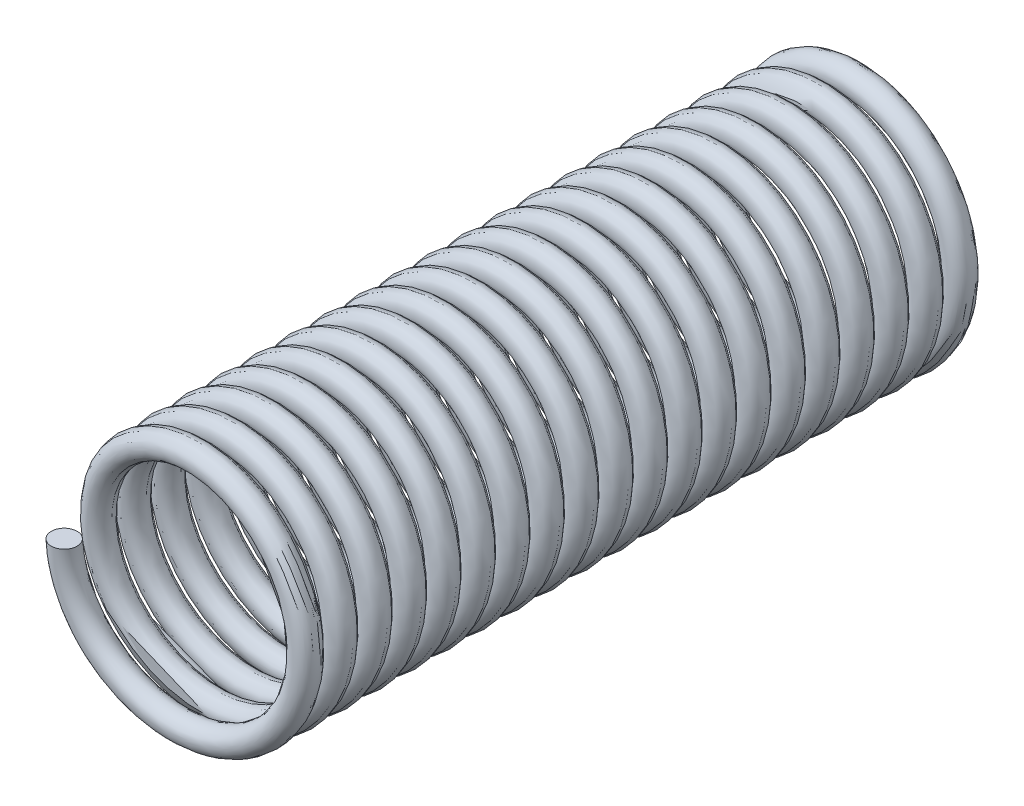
from build123d import *

# Parameters (mm, degrees)
SWEEP_1_PITCH       = 2
SWEEP_1_HEIGHT      = 40
SWEEP_1_RADIUS      = 6.5
SWEEP_1_START_ANGLE = -180
SKETCH_3_R          = 0.75


with BuildPart() as part:
    # Sweep 1: sweep along a helix
    with BuildLine() as sweep_1_path:
        add(Helix(SWEEP_1_PITCH, SWEEP_1_HEIGHT, SWEEP_1_RADIUS, center=(0, 0, 0), direction=(0, 0, 1), lefthand=True, mode=Mode.PRIVATE).rotate(Axis((0, 0, 0), (0, 0, 1)), SWEEP_1_START_ANGLE))
    # Sketch 3 → Sweep 1 (sweep)
    with BuildSketch(Plane(origin=(0, 0, 0), x_dir=(1, 0, 0), z_dir=(0, 1, 0))):
        with Locations((-6.5, 0)):
            Circle(SKETCH_3_R)
    sweep(path=sweep_1_path.line, is_frenet=True)


solid = part.part
